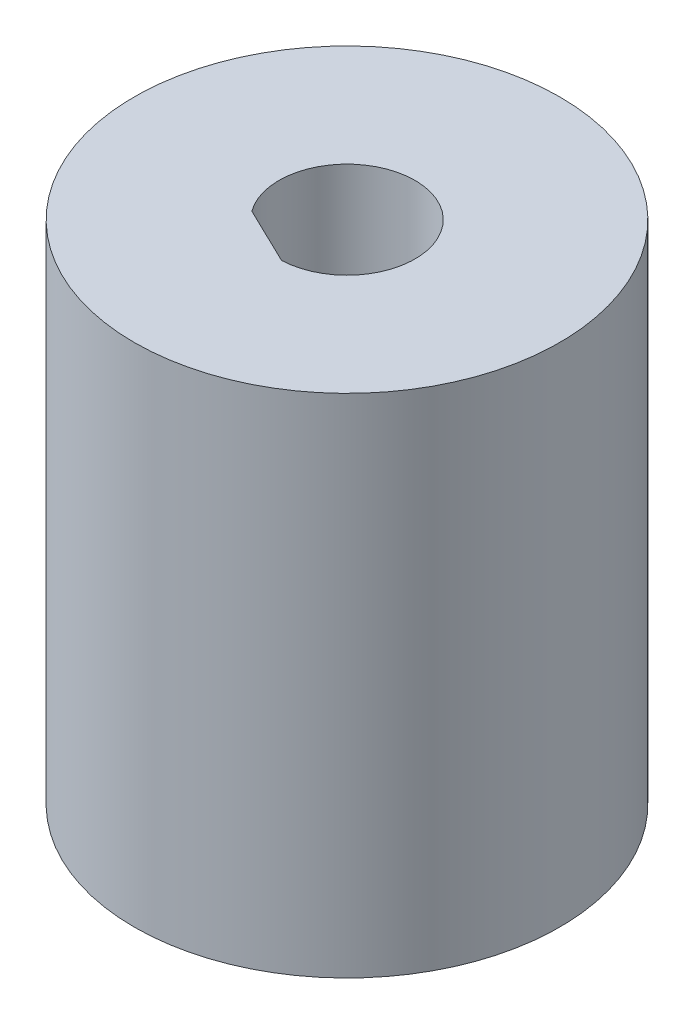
ISO-10303-21;
HEADER;
FILE_DESCRIPTION(('STEP AP214'),'2;1');
FILE_NAME('part.step','',(''),(''),'','','');
FILE_SCHEMA(('AUTOMOTIVE_DESIGN { 1 0 10303 214 1 1 1 1 }'));
ENDSEC;
DATA;
#1=APPLICATION_CONTEXT('core data for automotive mechanical design processes');
#2=APPLICATION_PROTOCOL_DEFINITION('international standard','automotive_design',2000,#1);
#3=PRODUCT_CONTEXT('',#1,'mechanical');
#4=PRODUCT('Part','Part','',(#3));
#5=PRODUCT_RELATED_PRODUCT_CATEGORY('part','',(#4));
#6=PRODUCT_DEFINITION_FORMATION('','',#4);
#7=PRODUCT_DEFINITION_CONTEXT('part definition',#1,'design');
#8=PRODUCT_DEFINITION('design','',#6,#7);
#9=PRODUCT_DEFINITION_SHAPE('','',#8);
#10=(LENGTH_UNIT() NAMED_UNIT(*) SI_UNIT(.MILLI.,.METRE.));
#11=(NAMED_UNIT(*) PLANE_ANGLE_UNIT() SI_UNIT($,.RADIAN.));
#12=(NAMED_UNIT(*) SI_UNIT($,.STERADIAN.) SOLID_ANGLE_UNIT());
#13=UNCERTAINTY_MEASURE_WITH_UNIT(LENGTH_MEASURE(1.E-05),#10,'distance_accuracy_value','');
#14=(GEOMETRIC_REPRESENTATION_CONTEXT(3) GLOBAL_UNCERTAINTY_ASSIGNED_CONTEXT((#13)) GLOBAL_UNIT_ASSIGNED_CONTEXT((#10,
#11,#12)) REPRESENTATION_CONTEXT('',''));
#15=CARTESIAN_POINT('',(0.,0.,0.));
#16=DIRECTION('',(0.,0.,1.));
#17=DIRECTION('',(1.,0.,0.));
#18=AXIS2_PLACEMENT_3D('',#15,#16,#17);
#19=CARTESIAN_POINT('',(0.,11.9,0.));
#20=DIRECTION('',(0.,-1.,0.));
#21=DIRECTION('',(0.,0.,-1.));
#22=AXIS2_PLACEMENT_3D('',#19,#20,#21);
#23=CYLINDRICAL_SURFACE('',#22,5.);
#24=CARTESIAN_POINT('',(0.,11.9,0.));
#25=DIRECTION('',(0.,1.,0.));
#26=DIRECTION('',(0.,0.,1.));
#27=AXIS2_PLACEMENT_3D('',#24,#25,#26);
#28=CIRCLE('',#27,5.);
#29=CARTESIAN_POINT('',(0.,11.9,5.));
#30=VERTEX_POINT('',#29);
#31=EDGE_CURVE('E11',#30,#30,#28,.T.);
#32=ORIENTED_EDGE('',*,*,#31,.F.);
#33=EDGE_LOOP('',(#32));
#34=FACE_BOUND('',#33,.T.);
#35=CARTESIAN_POINT('',(0.,0.,0.));
#36=DIRECTION('',(0.,1.,0.));
#37=DIRECTION('',(0.,0.,1.));
#38=AXIS2_PLACEMENT_3D('',#35,#36,#37);
#39=CIRCLE('',#38,5.);
#40=CARTESIAN_POINT('',(0.,0.,5.));
#41=VERTEX_POINT('',#40);
#42=EDGE_CURVE('E40',#41,#41,#39,.T.);
#43=ORIENTED_EDGE('',*,*,#42,.T.);
#44=EDGE_LOOP('',(#43));
#45=FACE_BOUND('',#44,.T.);
#46=ADVANCED_FACE('F37',(#34,#45),#23,.T.);
#47=CARTESIAN_POINT('',(0.,11.9,0.));
#48=DIRECTION('',(0.,1.,0.));
#49=DIRECTION('',(0.,0.,1.));
#50=AXIS2_PLACEMENT_3D('',#47,#48,#49);
#51=PLANE('',#50);
#52=DIRECTION('',(0.900123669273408,0.,0.435634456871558));
#53=VECTOR('',#52,1.);
#54=CARTESIAN_POINT('',(-0.61569498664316,11.9,1.27217124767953));
#55=LINE('',#54,#53);
#56=CARTESIAN_POINT('',(-1.29078773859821,11.9,0.945445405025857));
#57=VERTEX_POINT('',#56);
#58=CARTESIAN_POINT('',(0.0593977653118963,11.9,1.59889709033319));
#59=VERTEX_POINT('',#58);
#60=EDGE_CURVE('E52',#57,#59,#55,.T.);
#61=ORIENTED_EDGE('',*,*,#60,.F.);
#62=CARTESIAN_POINT('',(0.,11.9,0.));
#63=DIRECTION('',(0.,1.,0.));
#64=DIRECTION('',(0.,0.,1.));
#65=AXIS2_PLACEMENT_3D('',#62,#63,#64);
#66=CIRCLE('',#65,1.6);
#67=EDGE_CURVE('E72',#59,#57,#66,.T.);
#68=ORIENTED_EDGE('',*,*,#67,.F.);
#69=EDGE_LOOP('',(#61,#68));
#70=FACE_BOUND('',#69,.T.);
#71=ORIENTED_EDGE('',*,*,#31,.T.);
#72=EDGE_LOOP('',(#71));
#73=FACE_BOUND('',#72,.T.);
#74=ADVANCED_FACE('F77',(#70,#73),#51,.T.);
#75=CARTESIAN_POINT('',(0.,0.,0.));
#76=DIRECTION('',(0.,1.,0.));
#77=DIRECTION('',(0.,0.,1.));
#78=AXIS2_PLACEMENT_3D('',#75,#76,#77);
#79=PLANE('',#78);
#80=CARTESIAN_POINT('',(0.,0.,0.));
#81=DIRECTION('',(0.,1.,0.));
#82=DIRECTION('',(0.,0.,1.));
#83=AXIS2_PLACEMENT_3D('',#80,#81,#82);
#84=CIRCLE('',#83,1.6);
#85=CARTESIAN_POINT('',(0.0593977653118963,0.,1.59889709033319));
#86=VERTEX_POINT('',#85);
#87=CARTESIAN_POINT('',(-1.29078773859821,0.,0.945445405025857));
#88=VERTEX_POINT('',#87);
#89=EDGE_CURVE('E82',#86,#88,#84,.T.);
#90=ORIENTED_EDGE('',*,*,#89,.T.);
#91=DIRECTION('',(0.900123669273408,0.,0.435634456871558));
#92=VECTOR('',#91,1.);
#93=CARTESIAN_POINT('',(-0.61569498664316,0.,1.27217124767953));
#94=LINE('',#93,#92);
#95=EDGE_CURVE('E57',#88,#86,#94,.T.);
#96=ORIENTED_EDGE('',*,*,#95,.T.);
#97=EDGE_LOOP('',(#90,#96));
#98=FACE_BOUND('',#97,.T.);
#99=ORIENTED_EDGE('',*,*,#42,.F.);
#100=EDGE_LOOP('',(#99));
#101=FACE_BOUND('',#100,.T.);
#102=ADVANCED_FACE('F89',(#98,#101),#79,.F.);
#103=CARTESIAN_POINT('',(-0.61569498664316,0.,1.27217124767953));
#104=DIRECTION('',(-0.435634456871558,0.,0.900123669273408));
#105=DIRECTION('',(0.900123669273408,0.,0.435634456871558));
#106=AXIS2_PLACEMENT_3D('',#103,#104,#105);
#107=PLANE('',#106);
#108=ORIENTED_EDGE('',*,*,#60,.T.);
#109=DIRECTION('',(0.,1.,0.));
#110=VECTOR('',#109,1.);
#111=CARTESIAN_POINT('',(0.0593977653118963,0.,1.59889709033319));
#112=LINE('',#111,#110);
#113=EDGE_CURVE('E69',#86,#59,#112,.T.);
#114=ORIENTED_EDGE('',*,*,#113,.F.);
#115=ORIENTED_EDGE('',*,*,#95,.F.);
#116=DIRECTION('',(0.,1.,0.));
#117=VECTOR('',#116,1.);
#118=CARTESIAN_POINT('',(-1.29078773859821,0.,0.945445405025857));
#119=LINE('',#118,#117);
#120=EDGE_CURVE('E62',#88,#57,#119,.T.);
#121=ORIENTED_EDGE('',*,*,#120,.T.);
#122=EDGE_LOOP('',(#108,#114,#115,#121));
#123=FACE_BOUND('',#122,.T.);
#124=ADVANCED_FACE('F64',(#123),#107,.F.);
#125=CARTESIAN_POINT('',(0.,0.,0.));
#126=DIRECTION('',(0.,1.,0.));
#127=DIRECTION('',(0.,0.,1.));
#128=AXIS2_PLACEMENT_3D('',#125,#126,#127);
#129=CYLINDRICAL_SURFACE('',#128,1.6);
#130=ORIENTED_EDGE('',*,*,#67,.T.);
#131=ORIENTED_EDGE('',*,*,#120,.F.);
#132=ORIENTED_EDGE('',*,*,#89,.F.);
#133=ORIENTED_EDGE('',*,*,#113,.T.);
#134=EDGE_LOOP('',(#130,#131,#132,#133));
#135=FACE_BOUND('',#134,.T.);
#136=ADVANCED_FACE('F73',(#135),#129,.F.);
#137=CLOSED_SHELL('',(#46,#74,#102,#124,#136));
#138=MANIFOLD_SOLID_BREP('B2',#137);
#139=ADVANCED_BREP_SHAPE_REPRESENTATION('',(#18,#138),#14);
#140=SHAPE_DEFINITION_REPRESENTATION(#9,#139);
ENDSEC;
END-ISO-10303-21;
